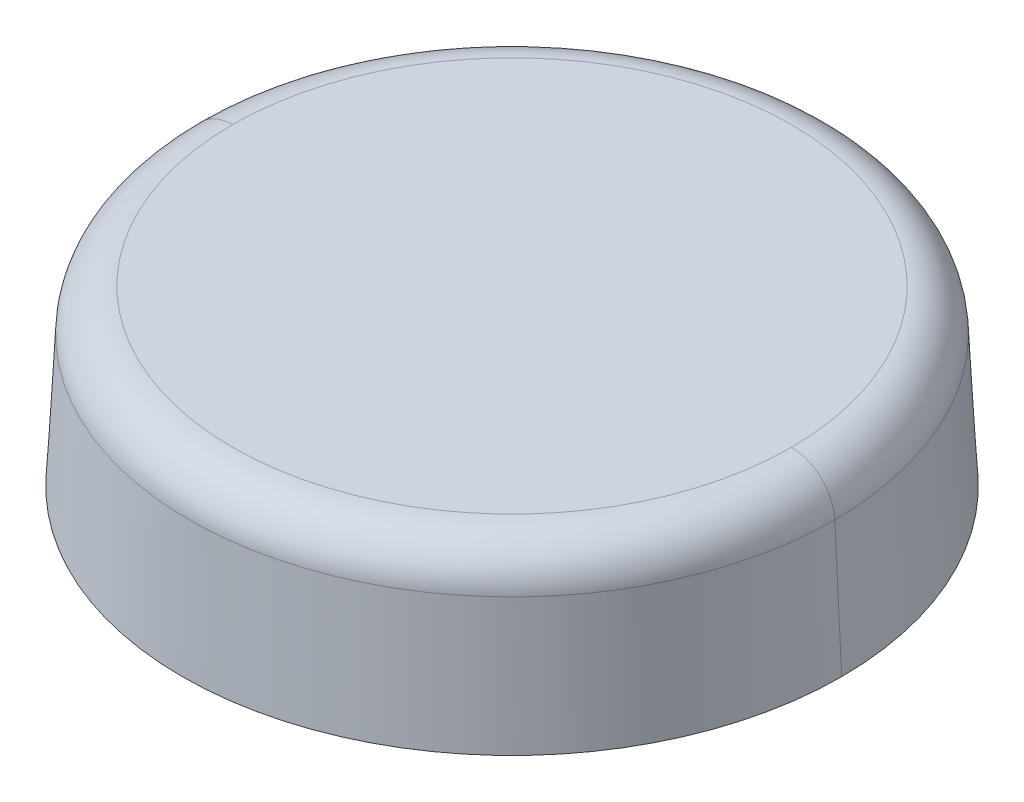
ISO-10303-21;
HEADER;
FILE_DESCRIPTION(('STEP AP214'),'2;1');
FILE_NAME('part.step','',(''),(''),'','','');
FILE_SCHEMA(('AUTOMOTIVE_DESIGN { 1 0 10303 214 1 1 1 1 }'));
ENDSEC;
DATA;
#1=APPLICATION_CONTEXT('core data for automotive mechanical design processes');
#2=APPLICATION_PROTOCOL_DEFINITION('international standard','automotive_design',2000,#1);
#3=PRODUCT_CONTEXT('',#1,'mechanical');
#4=PRODUCT('Part','Part','',(#3));
#5=PRODUCT_RELATED_PRODUCT_CATEGORY('part','',(#4));
#6=PRODUCT_DEFINITION_FORMATION('','',#4);
#7=PRODUCT_DEFINITION_CONTEXT('part definition',#1,'design');
#8=PRODUCT_DEFINITION('design','',#6,#7);
#9=PRODUCT_DEFINITION_SHAPE('','',#8);
#10=(LENGTH_UNIT() NAMED_UNIT(*) SI_UNIT(.MILLI.,.METRE.));
#11=(NAMED_UNIT(*) PLANE_ANGLE_UNIT() SI_UNIT($,.RADIAN.));
#12=(NAMED_UNIT(*) SI_UNIT($,.STERADIAN.) SOLID_ANGLE_UNIT());
#13=UNCERTAINTY_MEASURE_WITH_UNIT(LENGTH_MEASURE(1.E-05),#10,'distance_accuracy_value','');
#14=(GEOMETRIC_REPRESENTATION_CONTEXT(3) GLOBAL_UNCERTAINTY_ASSIGNED_CONTEXT((#13)) GLOBAL_UNIT_ASSIGNED_CONTEXT((#10,
#11,#12)) REPRESENTATION_CONTEXT('',''));
#15=CARTESIAN_POINT('',(0.,0.,0.));
#16=DIRECTION('',(0.,0.,1.));
#17=DIRECTION('',(1.,0.,0.));
#18=AXIS2_PLACEMENT_3D('',#15,#16,#17);
#19=CARTESIAN_POINT('',(0.,-5.,0.));
#20=DIRECTION('',(0.,-1.,0.));
#21=DIRECTION('',(0.,0.,-1.));
#22=AXIS2_PLACEMENT_3D('',#19,#20,#21);
#23=PLANE('',#22);
#24=CARTESIAN_POINT('',(0.,-4.999999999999,0.));
#25=DIRECTION('',(0.,1.,0.));
#26=DIRECTION('',(1.,0.,0.));
#27=AXIS2_PLACEMENT_3D('',#24,#25,#26);
#28=CIRCLE('',#27,19.);
#29=CARTESIAN_POINT('',(19.,-4.999999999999,0.));
#30=VERTEX_POINT('',#29);
#31=CARTESIAN_POINT('',(-19.,-4.999999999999,0.));
#32=VERTEX_POINT('',#31);
#33=EDGE_CURVE('E69',#30,#32,#28,.T.);
#34=ORIENTED_EDGE('',*,*,#33,.F.);
#35=CARTESIAN_POINT('',(0.,-4.999999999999,0.));
#36=DIRECTION('',(0.,1.,0.));
#37=DIRECTION('',(-1.,0.,0.));
#38=AXIS2_PLACEMENT_3D('',#35,#36,#37);
#39=CIRCLE('',#38,19.);
#40=EDGE_CURVE('E10',#32,#30,#39,.T.);
#41=ORIENTED_EDGE('',*,*,#40,.F.);
#42=EDGE_LOOP('',(#34,#41));
#43=FACE_BOUND('',#42,.T.);
#44=ADVANCED_FACE('F16',(#43),#23,.T.);
#45=CARTESIAN_POINT('',(0.,-1.184580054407,0.));
#46=DIRECTION('',(0.,-1.,0.));
#47=DIRECTION('',(-1.,0.,0.));
#48=AXIS2_PLACEMENT_3D('',#45,#46,#47);
#49=CONICAL_SURFACE('',#48,18.80004231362,0.0523598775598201);
#50=DIRECTION('',(0.0523359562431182,0.998629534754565,0.));
#51=VECTOR('',#50,1.);
#52=CARTESIAN_POINT('',(-19.,-4.999999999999,0.));
#53=LINE('',#52,#51);
#54=CARTESIAN_POINT('',(-18.60008462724,2.630839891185,0.));
#55=VERTEX_POINT('',#54);
#56=EDGE_CURVE('E66',#32,#55,#53,.T.);
#57=ORIENTED_EDGE('',*,*,#56,.F.);
#58=ORIENTED_EDGE('',*,*,#40,.T.);
#59=DIRECTION('',(-0.0523359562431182,0.998629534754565,0.));
#60=VECTOR('',#59,1.);
#61=CARTESIAN_POINT('',(19.,-4.999999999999,0.));
#62=LINE('',#61,#60);
#63=CARTESIAN_POINT('',(18.60008462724,2.630839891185,1.38143793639E-13));
#64=VERTEX_POINT('',#63);
#65=EDGE_CURVE('E64',#30,#64,#62,.T.);
#66=ORIENTED_EDGE('',*,*,#65,.T.);
#67=CARTESIAN_POINT('',(0.,2.630839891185,0.));
#68=DIRECTION('',(0.,-1.,0.));
#69=DIRECTION('',(1.,0.,0.));
#70=AXIS2_PLACEMENT_3D('',#67,#68,#69);
#71=CIRCLE('',#70,18.60008462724);
#72=EDGE_CURVE('E27',#64,#55,#71,.T.);
#73=ORIENTED_EDGE('',*,*,#72,.T.);
#74=EDGE_LOOP('',(#57,#58,#66,#73));
#75=FACE_BOUND('',#74,.T.);
#76=ADVANCED_FACE('F61',(#75),#49,.T.);
#77=CARTESIAN_POINT('',(0.,2.5,0.));
#78=DIRECTION('',(0.,-1.,0.));
#79=DIRECTION('',(-0.999979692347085,0.,-0.0063729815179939));
#80=AXIS2_PLACEMENT_3D('',#77,#78,#79);
#81=TOROIDAL_SURFACE('',#80,16.10351079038,2.5);
#82=CARTESIAN_POINT('',(-16.10351079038,2.5,0.));
#83=DIRECTION('',(0.,0.,1.));
#84=DIRECTION('',(2.89200191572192E-09,1.,0.));
#85=AXIS2_PLACEMENT_3D('',#82,#83,#84);
#86=CIRCLE('',#85,2.5);
#87=CARTESIAN_POINT('',(-16.10351078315,5.,0.));
#88=VERTEX_POINT('',#87);
#89=EDGE_CURVE('E88',#88,#55,#86,.T.);
#90=ORIENTED_EDGE('',*,*,#89,.T.);
#91=ORIENTED_EDGE('',*,*,#72,.F.);
#92=CARTESIAN_POINT('',(16.10351079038,2.5,0.));
#93=DIRECTION('',(0.,0.,-1.));
#94=DIRECTION('',(-2.89200191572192E-09,1.,0.));
#95=AXIS2_PLACEMENT_3D('',#92,#93,#94);
#96=CIRCLE('',#95,2.5);
#97=CARTESIAN_POINT('',(16.10351078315,5.,0.));
#98=VERTEX_POINT('',#97);
#99=EDGE_CURVE('E84',#98,#64,#96,.T.);
#100=ORIENTED_EDGE('',*,*,#99,.F.);
#101=CARTESIAN_POINT('',(0.,5.,0.));
#102=DIRECTION('',(0.,1.,0.));
#103=DIRECTION('',(0.999979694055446,0.,0.0063727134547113));
#104=AXIS2_PLACEMENT_3D('',#101,#102,#103);
#105=CIRCLE('',#104,16.10351078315);
#106=EDGE_CURVE('E20',#88,#98,#105,.T.);
#107=ORIENTED_EDGE('',*,*,#106,.F.);
#108=EDGE_LOOP('',(#90,#91,#100,#107));
#109=FACE_BOUND('',#108,.T.);
#110=ADVANCED_FACE('F154',(#109),#81,.T.);
#111=CARTESIAN_POINT('',(0.,5.,0.));
#112=DIRECTION('',(0.,-1.,0.));
#113=DIRECTION('',(0.,0.,-1.));
#114=AXIS2_PLACEMENT_3D('',#111,#112,#113);
#115=PLANE('',#114);
#116=CARTESIAN_POINT('',(0.,5.,0.));
#117=DIRECTION('',(0.,-1.,0.));
#118=DIRECTION('',(-0.999979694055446,0.,-0.0063727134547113));
#119=AXIS2_PLACEMENT_3D('',#116,#117,#118);
#120=CIRCLE('',#119,16.10351078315);
#121=EDGE_CURVE('E89',#88,#98,#120,.T.);
#122=ORIENTED_EDGE('',*,*,#121,.F.);
#123=ORIENTED_EDGE('',*,*,#106,.T.);
#124=EDGE_LOOP('',(#122,#123));
#125=FACE_BOUND('',#124,.T.);
#126=ADVANCED_FACE('F149',(#125),#115,.F.);
#127=CARTESIAN_POINT('',(0.,2.5,0.));
#128=DIRECTION('',(0.,-1.,0.));
#129=DIRECTION('',(0.999979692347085,0.,0.0063729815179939));
#130=AXIS2_PLACEMENT_3D('',#127,#128,#129);
#131=TOROIDAL_SURFACE('',#130,16.10351079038,2.5);
#132=ORIENTED_EDGE('',*,*,#99,.T.);
#133=CARTESIAN_POINT('',(0.,2.630839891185,0.));
#134=DIRECTION('',(0.,-1.,0.));
#135=DIRECTION('',(-0.999979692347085,0.,-0.00637298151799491));
#136=AXIS2_PLACEMENT_3D('',#133,#134,#135);
#137=CIRCLE('',#136,18.60008462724);
#138=EDGE_CURVE('E76',#55,#64,#137,.T.);
#139=ORIENTED_EDGE('',*,*,#138,.F.);
#140=ORIENTED_EDGE('',*,*,#89,.F.);
#141=ORIENTED_EDGE('',*,*,#121,.T.);
#142=EDGE_LOOP('',(#132,#139,#140,#141));
#143=FACE_BOUND('',#142,.T.);
#144=ADVANCED_FACE('F18',(#143),#131,.T.);
#145=CARTESIAN_POINT('',(0.,-1.184580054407,0.));
#146=DIRECTION('',(0.,-1.,0.));
#147=DIRECTION('',(-1.,0.,0.));
#148=AXIS2_PLACEMENT_3D('',#145,#146,#147);
#149=CONICAL_SURFACE('',#148,18.80004231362,0.0523598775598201);
#150=ORIENTED_EDGE('',*,*,#65,.F.);
#151=ORIENTED_EDGE('',*,*,#33,.T.);
#152=ORIENTED_EDGE('',*,*,#56,.T.);
#153=ORIENTED_EDGE('',*,*,#138,.T.);
#154=EDGE_LOOP('',(#150,#151,#152,#153));
#155=FACE_BOUND('',#154,.T.);
#156=ADVANCED_FACE('F74',(#155),#149,.T.);
#157=CLOSED_SHELL('',(#44,#76,#110,#126,#144,#156));
#158=MANIFOLD_SOLID_BREP('B1',#157);
#159=ADVANCED_BREP_SHAPE_REPRESENTATION('',(#18,#158),#14);
#160=SHAPE_DEFINITION_REPRESENTATION(#9,#159);
ENDSEC;
END-ISO-10303-21;
